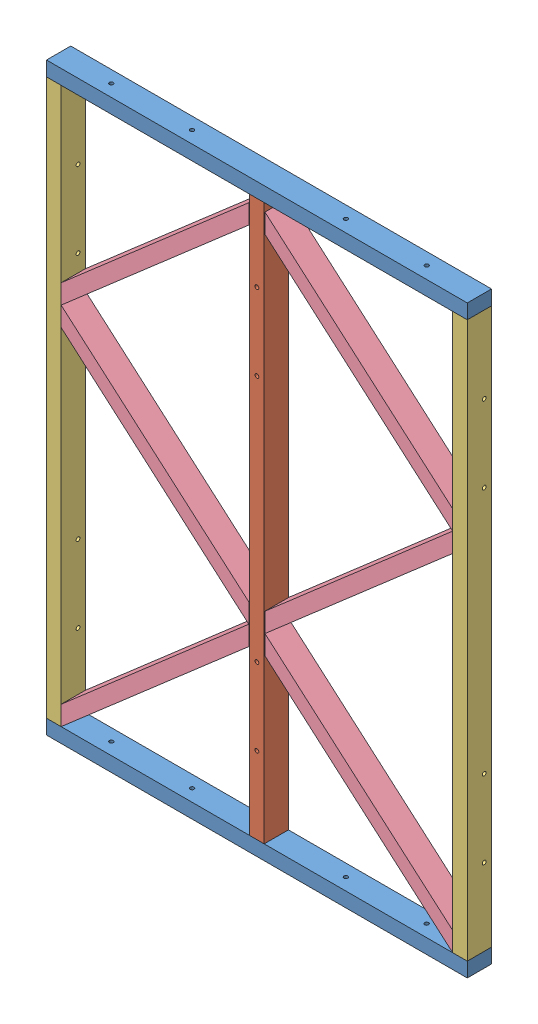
SolidWorks assembly #03 Back Piece.SLDASM, configuration Default (file format 15000). Lengths in mm.
Overall size (1094 1520 63).
11 component instances, 4 part files, 18 mates.
Components (placement in the parent):
- D - Back CLS Bottom-1: D - Back CLS Bottom.SLDPRT [Default] at (-388.5254 515.5197 1156.5636) size (1094 38 63)
- B - 5ft CLS vertical-2: B - 5ft CLS vertical.SLDPRT [Default] at (240.4746 553.5197 1093.5636) x (0 0 1) z (-1 0 0) size (63 1444 38)
- E - 5ft CLS vertical side holes-1: E - 5ft CLS vertical side holes.SLDPRT [Default] at (-287.5254 553.5197 1093.5636) x (0 0 1) z (-1 0 0) size (63 1444 38)
- E - 5ft CLS vertical side holes-2: E - 5ft CLS vertical side holes.SLDPRT [Default] at (768.4746 553.5197 1093.5636) x (0 0 1) z (-1 0 0) size (63 1444 38)
- D - Back CLS Bottom-2: D - Back CLS Bottom.SLDPRT [Default] at (-388.5254 1997.5197 1156.5636) size (1094 38 63)
- F - back angled brace-1: F - back angled brace.SLDPRT [Default] at (-287.5254 553.5197 1093.5636) size (488 474.56 63)
- F - back angled brace-2: F - back angled brace.SLDPRT [Default] at (-287.5254 1502.6445 1156.5636) x (1 0 0) z (0 0 -1) size (488 474.56 63)
- F - back angled brace-3: F - back angled brace.SLDPRT [Default] at (-287.5254 1502.6445 1093.5636) size (488 474.56 63)
- F - back angled brace-5: F - back angled brace.SLDPRT [Default] at (730.4746 1502.6445 1156.5636) x (-1 0 0) z (0 0 -1) size (488 474.56 63)
- F - back angled brace-6: F - back angled brace.SLDPRT [Default] at (730.4746 1502.6445 1093.5636) x (-1 0 0) z (0 0 1) size (488 474.56 63)
- F - back angled brace-7: F - back angled brace.SLDPRT [Default] at (730.4746 553.5197 1156.5636) x (-1 0 0) z (0 0 -1) size (488 474.56 63)
Mates (geometry in assembly coordinates):
- Coincident4: coincident anti-aligned: plane of D - back 4ft-1 through (-388.5254 553.5197 1156.5636) normal (0 1 0); plane of B - 5ft -2xCLS vertical-2 through (202.4746 553.5197 1093.5636) normal (0 -1 0)
- Coincident5: coincident aligned: plane of D - back 4ft-1 through (-388.5254 553.5197 1156.5636) normal (0 0 1); plane of B - 5ft -2xCLS vertical-2 through (202.4746 553.5197 1156.5636) normal (0 0 1)
- Coincident11: coincident: point of D - Back CLS Bottom-1; point of B - 5ft CLS vertical-2
- Coincident12: coincident anti-aligned: plane of D - back 4ft-1 through (-388.5254 553.5197 1156.5636) normal (0 1 0); plane of E - 5ft CLS vertical side holes-1 through (-325.5254 553.5197 1093.5636) normal (0 -1 0)
- Coincident13: coincident aligned: plane of D - back 4ft-1 through (-325.5254 515.5187 1156.5636) normal (-1 0 0); plane of E - 5ft CLS vertical side holes-1 through (-325.5254 553.5197 1093.5636) normal (-1 0 0)
- Coincident14: coincident aligned: plane of D - back 4ft-1 through (-388.5254 553.5197 1156.5636) normal (0 0 1); plane of E - 5ft CLS vertical side holes-1 through (-325.5254 553.5197 1156.5636) normal (0 0 1)
- Coincident15: coincident anti-aligned: plane of E - 5ft CLS vertical side holes-1 through (-325.5254 1997.5197 1093.5636) normal (0 1 0); plane of D - back 4ft-2 through (-388.5254 1997.5197 1156.5636) normal (0 -1 0)
- Coincident16: coincident aligned: plane of E - 5ft CLS vertical side holes-1 through (-325.5254 553.5197 1156.5636) normal (0 0 1); plane of D - back 4ft-2 through (-388.5254 2035.5197 1156.5636) normal (0 0 1)
- Coincident17: coincident aligned: plane of E - 5ft CLS vertical side holes-1 through (-325.5254 553.5197 1093.5636) normal (-1 0 0); plane of D - back 4ft-2 through (-325.5254 1997.5187 1156.5636) normal (-1 0 0)
- Coincident18: coincident anti-aligned: plane of E - 5ft CLS vertical side holes-1 through (-287.5254 553.5197 1093.5636) normal (1 0 0); plane of F - back angled brace-1 through (-287.5254 553.5197 1156.5636) normal (-1 0 0)
- Coincident19: coincident aligned: plane of D - back 4ft-1 through (-388.5254 553.5197 1156.5636) normal (0 0 1); plane of F - back angled brace-1 through (-287.5254 553.5197 1156.5636) normal (0 0 1)
- Coincident20: coincident anti-aligned: line of E - 5ft CLS vertical side holes-1 through (-287.5254 553.5197 1093.5636) axis (0 0 1); line of F - back angled brace-1 through (-287.5254 553.5197 1156.5636) axis (0 0 -1)
- Coincident21: coincident anti-aligned: plane of E - 5ft CLS vertical side holes-1 through (-287.5254 553.5197 1093.5636) normal (1 0 0); plane of F - back angled brace-2 through (-287.5254 1502.6445 1093.5636) normal (-1 0 0)
- Coincident23: coincident aligned: plane of D - back 4ft-1 through (-388.5254 553.5197 1093.5636) normal (0 0 -1); plane of F - back angled brace-2 through (-287.5254 1502.6445 1093.5636) normal (0 0 -1)
- Coincident25: coincident anti-aligned: plane of E - 5ft CLS vertical side holes-1 through (-287.5254 553.5197 1093.5636) normal (1 0 0); plane of F - back angled brace-3 through (-287.5254 1502.6445 1156.5636) normal (-1 0 0)
- Coincident26: coincident aligned: plane of D - back 4ft-1 through (-388.5254 553.5197 1156.5636) normal (0 0 1); plane of F - back angled brace-3 through (-287.5254 1502.6445 1156.5636) normal (0 0 1)
- Coincident29: coincident anti-aligned: line of F - back angled brace-1 through (200.4746 1028.0821 1156.5636) axis (0 0 -1); line of F - back angled brace-2 through (200.4746 1028.0821 1093.5636) axis (0 0 1)
- Coincident30: coincident anti-aligned: line of F - back angled brace-2 through (-287.5254 1502.6445 1093.5636) axis (0 0 1); line of F - back angled brace-3 through (-287.5254 1502.6445 1156.5636) axis (0 0 -1)
